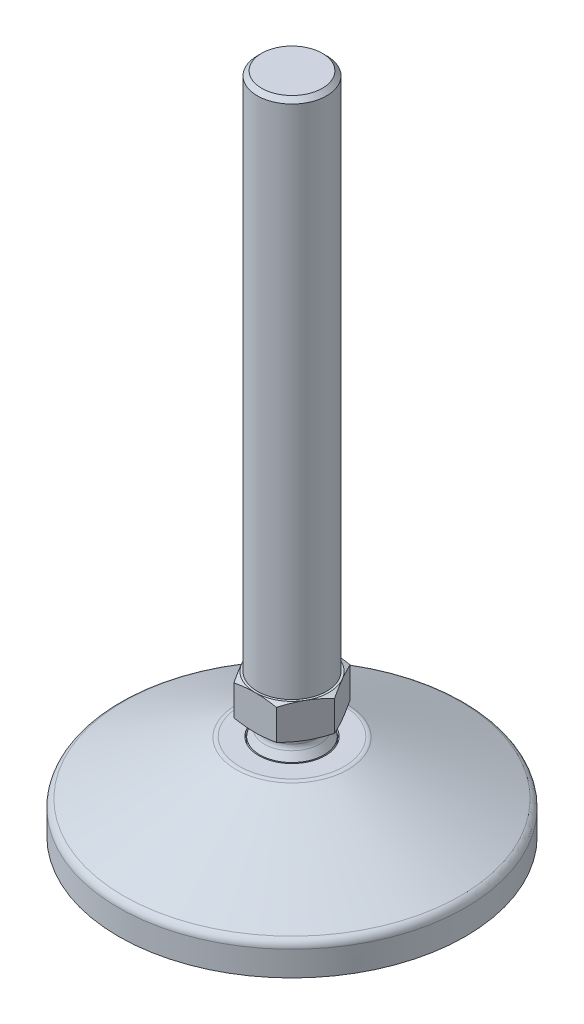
from build123d import *

# Parameters (mm, degrees)
SKETCH1_R           = 35
BOSS_EXTRUDE1_DEPTH = 2
SKETCH2_R           = 40
BOSS_EXTRUDE2_DEPTH = 7
SKETCH3_R           = 12.5
SKETCH4_R           = 7.4
SKETCH5_R           = 6
SKETCH11_R          = 7.7
SKETCH11_R_2        = 7.4
CUT_EXTRUDE1_DEPTH  = 1
SKETCH6_R           = 6
BOSS_EXTRUDE3_DEPTH = 2.9
SKETCH7_R           = 8
BOSS_EXTRUDE4_DEPTH = 128
SKETCH8_R           = 8
BOSS_EXTRUDE5_DEPTH = 8
CHAMFER1_SIZE       = 1
BOSS_EXTRUDE6_DEPTH = 1
FILLET1_R           = 2
FILLET2_R           = 2
FILLET3_R           = 1


with BuildPart() as part:
    # Sketch1 → Boss-Extrude1 (new body)
    with BuildSketch(Plane(origin=(0, 0, 0), x_dir=(1, 0, 0), z_dir=(0, 1, 0))):
        with Locations(Location((0, 0, 0), (0, 0, 270))):
            Circle(SKETCH1_R)
    extrude(amount=BOSS_EXTRUDE1_DEPTH)

    # Sketch2 → Boss-Extrude2 (add)
    with BuildSketch(Plane(origin=(0, 2, 0), x_dir=(1, 0, 0), z_dir=(0, 1, 0))):
        with Locations(Location((0, 0, 0), (0, 0, 270))):
            Circle(SKETCH2_R)
    extrude(amount=BOSS_EXTRUDE2_DEPTH)

    # Sketch3 → section 1 of loft1
    with BuildSketch(Plane(origin=(0, 22, 0), x_dir=(1, 0, 0), z_dir=(0, 1, 0)), mode=Mode.PRIVATE) as loft1_s1:
        Circle(SKETCH3_R)
    # loft up to a face of the part (loft1)
    loft([Face(Wire([part.edges().sort_by_distance((29.158745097, 9, -27.381884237))[0]])), loft1_s1.sketch])

    # Sketch4 → Loft2 section 0
    with BuildSketch(Plane(origin=(0, 22, 0), x_dir=(1, 0, 0), z_dir=(0, 1, 0))):
        Circle(SKETCH4_R)
    # Sketch5 → Loft2 section 1
    with BuildSketch(Plane(origin=(0, 24.1, 0), x_dir=(1, 0, 0), z_dir=(0, 1, 0))):
        Circle(SKETCH5_R)
    loft()

    # Sketch11 → Cut-Extrude1 (cut)
    with BuildSketch(Plane(origin=(0, 22, 0), x_dir=(1, 0, 0), z_dir=(0, 1, 0))):
        with Locations(Location((0, 0, 0), (0, 0, 270))):
            Circle(SKETCH11_R)
        with Locations(Location((0, 0, 0), (0, 0, 270))):
            Circle(SKETCH11_R_2, mode=Mode.SUBTRACT)
    extrude(amount=-CUT_EXTRUDE1_DEPTH, mode=Mode.SUBTRACT)

    # Sketch6 → Boss-Extrude3 (add)
    with BuildSketch(Plane(origin=(0, 24.1, 0), x_dir=(1, 0, 0), z_dir=(0, 1, 0))):
        with Locations(Location((0, 0, 0), (0, 0, 270))):
            Circle(SKETCH6_R)
    extrude(amount=BOSS_EXTRUDE3_DEPTH)

    # Sketch7 → Boss-Extrude4 (add)
    with BuildSketch(Plane(origin=(0, 27, 0), x_dir=(1, 0, 0), z_dir=(0, 1, 0))):
        with Locations(Location((0, 0, 0), (0, 0, 270))):
            Circle(SKETCH7_R)
    extrude(amount=BOSS_EXTRUDE4_DEPTH)

    # Sketch8 → Boss-Extrude5 (add)
    with BuildSketch(Plane(origin=(0, 27, 0), x_dir=(1, 0, 0), z_dir=(0, 1, 0))):
        Polygon((9.814954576, 0), (4.907477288, 8.5), (-4.907477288, 8.5), (-9.814954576, 0), (-4.907477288, -8.5), (4.907477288, -8.5), align=None)
        with Locations(Location((0, 0, 0), (0, 0, 270))):
            Circle(SKETCH8_R, mode=Mode.SUBTRACT)
    extrude(amount=BOSS_EXTRUDE5_DEPTH)

    # Sketch9 → Cut-Revolve1 (revolve, cut)
    with BuildSketch(Plane.XY, mode=Mode.PRIVATE) as cut_revolve1_sk:
        Polygon((-8.5, 35), (-9.814954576, 34.5), (-9.814954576, 35), align=None)
        Polygon((-9.814954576, 27.5), (-8.5, 27), (-9.814954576, 27), align=None)
    revolve(cut_revolve1_sk.sketch.rotate(Axis((0, 155, 0), (0, -1, 0)), 90), axis=Axis((0, 155, 0), (0, -1, 0)), mode=Mode.SUBTRACT)

    # Chamfer1
    chamfer1_edges = [part.edges().sort_by_distance(p)[0] for p in [
        (0, 155, -8),
    ]]
    chamfer(chamfer1_edges, length=CHAMFER1_SIZE)

    # Sketch10 → Boss-Extrude6 (add)
    with BuildSketch(Plane.XZ):
        with BuildLine():
            Line((3, 6), (30.923292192, 6))
            ThreePointArc((30.923292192, 6), (21.176389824, 23.319745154), (3, 31.356817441))
            Line((3, 31.356817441), (3, 6))
        make_face()
        with BuildLine():
            Line((-3, -31.356817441), (-3, -6))
            Line((-3, -6), (-30.923292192, -6))
            ThreePointArc((-30.923292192, -6), (-21.176389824, -23.319745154), (-3, -31.356817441))
        make_face()
        with BuildLine():
            Line((3, -31.356817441), (3, -6))
            Line((3, -6), (30.923292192, -6))
            ThreePointArc((30.923292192, -6), (21.176389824, -23.319745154), (3, -31.356817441))
        make_face()
        with BuildLine():
            Line((-30.923292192, 6), (-3, 6))
            Line((-3, 6), (-3, 31.356817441))
            ThreePointArc((-3, 31.356817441), (-21.176389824, 23.319745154), (-30.923292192, 6))
        make_face()
    extrude(amount=BOSS_EXTRUDE6_DEPTH)

    # Fillet1
    fillet1_edges = [part.edges().sort_by_distance(p)[0] for p in [
        (0, 22, -12.5),
        (0, 9, -40),
    ]]
    fillet(fillet1_edges, radius=FILLET1_R)

    # Fillet2
    fillet2_edges = [part.edges().sort_by_distance(p)[0] for p in [
        (-4.242640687, 24.1, -4.242640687),
    ]]
    fillet(fillet2_edges, radius=FILLET2_R)

    # Fillet3
    fillet3_edges = [part.edges().sort_by_distance(p)[0] for p in [
        (3, -0.5, 31.356817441),
        (3, -0.5, 6),
        (30.923292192, -0.5, 6),
        (-30.923292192, -0.5, -6),
        (-3, -0.5, -31.356817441),
        (-3, -0.5, -6),
        (-3, -0.5, 31.356817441),
        (-30.923292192, -0.5, 6),
        (-3, -0.5, 6),
        (3, -0.5, -31.356817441),
        (30.923292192, -0.5, -6),
        (3, -0.5, -6),
    ]]
    fillet(fillet3_edges, radius=FILLET3_R)


solid = part.part
